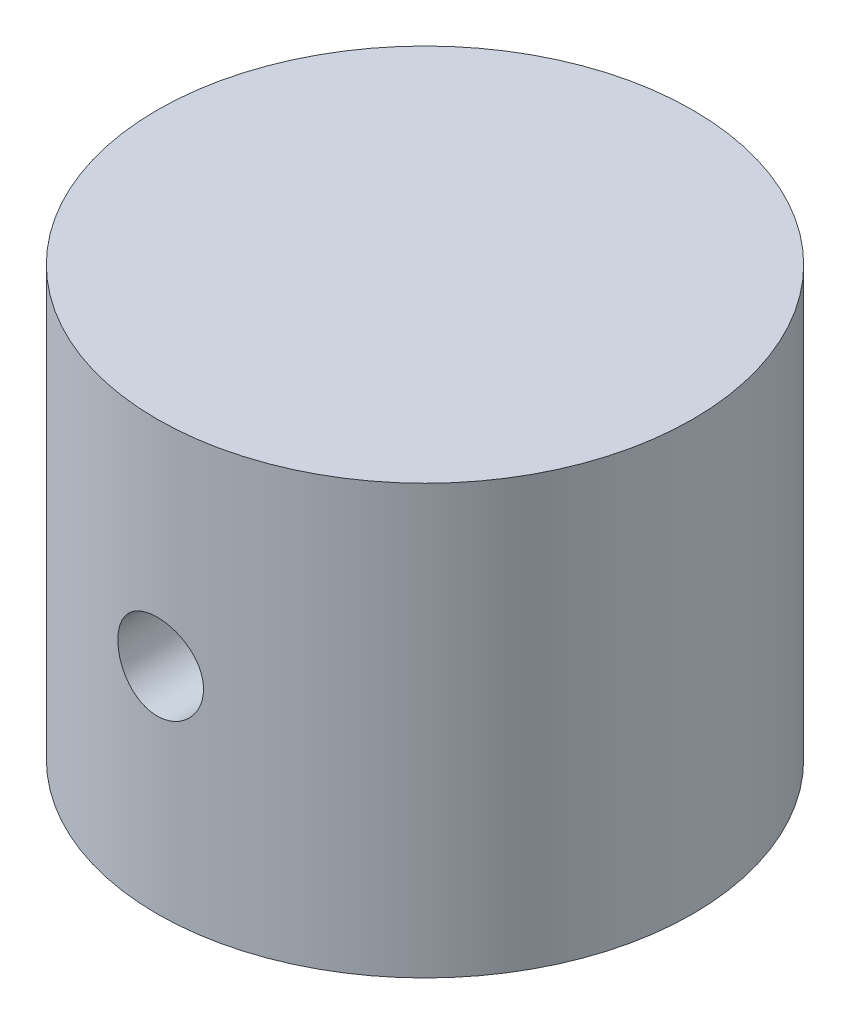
ISO-10303-21;
HEADER;
FILE_DESCRIPTION(('STEP AP214'),'2;1');
FILE_NAME('part.step','',(''),(''),'','','');
FILE_SCHEMA(('AUTOMOTIVE_DESIGN { 1 0 10303 214 1 1 1 1 }'));
ENDSEC;
DATA;
#1=APPLICATION_CONTEXT('core data for automotive mechanical design processes');
#2=APPLICATION_PROTOCOL_DEFINITION('international standard','automotive_design',2000,#1);
#3=PRODUCT_CONTEXT('',#1,'mechanical');
#4=PRODUCT('Part','Part','',(#3));
#5=PRODUCT_RELATED_PRODUCT_CATEGORY('part','',(#4));
#6=PRODUCT_DEFINITION_FORMATION('','',#4);
#7=PRODUCT_DEFINITION_CONTEXT('part definition',#1,'design');
#8=PRODUCT_DEFINITION('design','',#6,#7);
#9=PRODUCT_DEFINITION_SHAPE('','',#8);
#10=(LENGTH_UNIT() NAMED_UNIT(*) SI_UNIT(.MILLI.,.METRE.));
#11=(NAMED_UNIT(*) PLANE_ANGLE_UNIT() SI_UNIT($,.RADIAN.));
#12=(NAMED_UNIT(*) SI_UNIT($,.STERADIAN.) SOLID_ANGLE_UNIT());
#13=UNCERTAINTY_MEASURE_WITH_UNIT(LENGTH_MEASURE(1.E-05),#10,'distance_accuracy_value','');
#14=(GEOMETRIC_REPRESENTATION_CONTEXT(3) GLOBAL_UNCERTAINTY_ASSIGNED_CONTEXT((#13)) GLOBAL_UNIT_ASSIGNED_CONTEXT((#10,
#11,#12)) REPRESENTATION_CONTEXT('',''));
#15=CARTESIAN_POINT('',(0.,0.,0.));
#16=DIRECTION('',(0.,0.,1.));
#17=DIRECTION('',(1.,0.,0.));
#18=AXIS2_PLACEMENT_3D('',#15,#16,#17);
#19=CARTESIAN_POINT('',(0.,9.99999999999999,0.));
#20=DIRECTION('',(0.,1.,0.));
#21=DIRECTION('',(-1.,0.,0.));
#22=AXIS2_PLACEMENT_3D('',#19,#20,#21);
#23=CYLINDRICAL_SURFACE('',#22,12.5);
#24=CARTESIAN_POINT('',(0.,2.,-12.5));
#25=CARTESIAN_POINT('',(-0.111577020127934,1.99999547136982,-12.4999981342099));
#26=CARTESIAN_POINT('',(-0.223216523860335,1.99063139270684,-12.4984904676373));
#27=CARTESIAN_POINT('',(-0.443368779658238,1.95343555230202,-12.4926212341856));
#28=CARTESIAN_POINT('',(-0.551878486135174,1.92558639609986,-12.4882569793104));
#29=CARTESIAN_POINT('',(-0.762553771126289,1.85227911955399,-12.4771644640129));
#30=CARTESIAN_POINT('',(-0.864724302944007,1.80683495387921,-12.4704380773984));
#31=CARTESIAN_POINT('',(-1.05997584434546,1.69966320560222,-12.4553623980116));
#32=CARTESIAN_POINT('',(-1.15305798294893,1.63793764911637,-12.4470133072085));
#33=CARTESIAN_POINT('',(-1.32832749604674,1.49937439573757,-12.4295364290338));
#34=CARTESIAN_POINT('',(-1.41042286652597,1.42242102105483,-12.4204030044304));
#35=CARTESIAN_POINT('',(-1.56059410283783,1.25583553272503,-12.4024303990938));
#36=CARTESIAN_POINT('',(-1.62866911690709,1.16620264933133,-12.393591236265));
#37=CARTESIAN_POINT('',(-1.74923165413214,0.97617611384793,-12.377153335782));
#38=CARTESIAN_POINT('',(-1.80162899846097,0.875724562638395,-12.369561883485));
#39=CARTESIAN_POINT('',(-1.88877230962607,0.667304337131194,-12.3565566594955));
#40=CARTESIAN_POINT('',(-1.92351937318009,0.559336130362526,-12.3511427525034));
#41=CARTESIAN_POINT('',(-1.97408758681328,0.339919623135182,-12.3431614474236));
#42=CARTESIAN_POINT('',(-1.990067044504,0.228508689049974,-12.3405702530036));
#43=CARTESIAN_POINT('',(-2.00313711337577,0.00455901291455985,-12.3384556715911));
#44=CARTESIAN_POINT('',(-2.00022895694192,-0.107979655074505,-12.3389320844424));
#45=CARTESIAN_POINT('',(-1.97573547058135,-0.329865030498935,-12.3428771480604));
#46=CARTESIAN_POINT('',(-1.95432734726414,-0.43923187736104,-12.3463174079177));
#47=CARTESIAN_POINT('',(-1.8937194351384,-0.65280107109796,-12.3557581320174));
#48=CARTESIAN_POINT('',(-1.85451907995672,-0.757003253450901,-12.36175867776));
#49=CARTESIAN_POINT('',(-1.75925788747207,-0.957819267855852,-12.375674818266));
#50=CARTESIAN_POINT('',(-1.70312285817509,-1.05439729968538,-12.3835988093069));
#51=CARTESIAN_POINT('',(-1.57563852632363,-1.23683027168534,-12.4004630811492));
#52=CARTESIAN_POINT('',(-1.50428809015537,-1.32268441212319,-12.4094034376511));
#53=CARTESIAN_POINT('',(-1.34742984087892,-1.48225880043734,-12.4274181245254));
#54=CARTESIAN_POINT('',(-1.26176985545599,-1.55582950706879,-12.4364928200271));
#55=CARTESIAN_POINT('',(-1.07924037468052,-1.68757473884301,-12.4536592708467));
#56=CARTESIAN_POINT('',(-0.98237081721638,-1.74574917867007,-12.4617510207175));
#57=CARTESIAN_POINT('',(-0.78003588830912,-1.84506167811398,-12.4760500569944));
#58=CARTESIAN_POINT('',(-0.674564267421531,-1.88618721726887,-12.4822559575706));
#59=CARTESIAN_POINT('',(-0.45808983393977,-1.95009935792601,-12.492072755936));
#60=CARTESIAN_POINT('',(-0.34708744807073,-1.97288737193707,-12.4956838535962));
#61=CARTESIAN_POINT('',(-0.123992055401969,-1.99927647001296,-12.4998774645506));
#62=CARTESIAN_POINT('',(-0.0119239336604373,-2.00308296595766,-12.5004923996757));
#63=CARTESIAN_POINT('',(0.211249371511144,-1.99194761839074,-12.4987129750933));
#64=CARTESIAN_POINT('',(0.322354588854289,-1.97700643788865,-12.4963187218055));
#65=CARTESIAN_POINT('',(0.539818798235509,-1.92897070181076,-12.4888100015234));
#66=CARTESIAN_POINT('',(0.646200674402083,-1.89597717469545,-12.4837106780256));
#67=CARTESIAN_POINT('',(0.851922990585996,-1.81288053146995,-12.4713614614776));
#68=CARTESIAN_POINT('',(0.951263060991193,-1.7627765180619,-12.4641114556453));
#69=CARTESIAN_POINT('',(1.14097865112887,-1.64640600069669,-12.4481852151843));
#70=CARTESIAN_POINT('',(1.2312740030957,-1.58001036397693,-12.4394977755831));
#71=CARTESIAN_POINT('',(1.39951415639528,-1.43311984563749,-12.4216959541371));
#72=CARTESIAN_POINT('',(1.47745813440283,-1.35262402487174,-12.4125815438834));
#73=CARTESIAN_POINT('',(1.61953866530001,-1.17889961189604,-12.3948490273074));
#74=CARTESIAN_POINT('',(1.6835368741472,-1.08555722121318,-12.3862364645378));
#75=CARTESIAN_POINT('',(1.7949448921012,-0.889326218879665,-12.3705841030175));
#76=CARTESIAN_POINT('',(1.84235519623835,-0.786437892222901,-12.3635442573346));
#77=CARTESIAN_POINT('',(1.91903158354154,-0.574433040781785,-12.3518754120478));
#78=CARTESIAN_POINT('',(1.94836814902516,-0.465342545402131,-12.3472370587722));
#79=CARTESIAN_POINT('',(1.9882871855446,-0.243702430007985,-12.3408723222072));
#80=CARTESIAN_POINT('',(1.99887114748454,-0.13115308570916,-12.3391457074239));
#81=CARTESIAN_POINT('',(2.00094546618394,0.0928294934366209,-12.3388093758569));
#82=CARTESIAN_POINT('',(1.99265347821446,0.204260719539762,-12.3401641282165));
#83=CARTESIAN_POINT('',(1.95768017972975,0.424121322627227,-12.3457602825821));
#84=CARTESIAN_POINT('',(1.93099891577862,0.532550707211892,-12.3500016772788));
#85=CARTESIAN_POINT('',(1.86008521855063,0.743255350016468,-12.3608801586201));
#86=CARTESIAN_POINT('',(1.81587007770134,0.845536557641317,-12.3675148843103));
#87=CARTESIAN_POINT('',(1.71116577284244,1.04126446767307,-12.3824349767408));
#88=CARTESIAN_POINT('',(1.65067590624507,1.13471078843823,-12.3907204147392));
#89=CARTESIAN_POINT('',(1.51435663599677,1.31121858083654,-12.4081216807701));
#90=CARTESIAN_POINT('',(1.43836664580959,1.39415524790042,-12.417245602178));
#91=CARTESIAN_POINT('',(1.27354334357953,1.54617538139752,-12.4352300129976));
#92=CARTESIAN_POINT('',(1.18470706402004,1.61525563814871,-12.44409044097));
#93=CARTESIAN_POINT('',(0.996048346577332,1.73799746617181,-12.4606140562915));
#94=CARTESIAN_POINT('',(0.896160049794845,1.7915588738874,-12.4682693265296));
#95=CARTESIAN_POINT('',(0.688725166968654,1.88106129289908,-12.4814428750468));
#96=CARTESIAN_POINT('',(0.581186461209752,1.91702014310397,-12.4869633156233));
#97=CARTESIAN_POINT('',(0.394335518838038,1.96234573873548,-12.4940175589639));
#98=CARTESIAN_POINT('',(0.316163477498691,1.9764439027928,-12.4962491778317));
#99=CARTESIAN_POINT('',(0.158671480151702,1.99527257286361,-12.4992410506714));
#100=CARTESIAN_POINT('',(0.0793515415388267,2.00000322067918,-12.5000013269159));
#101=CARTESIAN_POINT('',(0.,2.,-12.5));
#102=B_SPLINE_CURVE_WITH_KNOTS('',3,(#24,#25,#26,#27,#28,#29,#30,#31,#32,#33,#34,#35,#36,#37,
#38,#39,#40,#41,#42,#43,#44,#45,#46,#47,#48,#49,#50,#51,#52,#53,#54,#55,#56,#57,#58,#59,#60,#61,
#62,#63,#64,#65,#66,#67,#68,#69,#70,#71,#72,#73,#74,#75,#76,#77,#78,#79,#80,#81,#82,#83,#84,#85,
#86,#87,#88,#89,#90,#91,#92,#93,#94,#95,#96,#97,#98,#99,#100,#101),.UNSPECIFIED.,.T.,.F.,(4,2,2,
2,2,2,2,2,2,2,2,2,2,2,2,2,2,2,2,2,2,2,2,2,2,2,2,2,2,2,2,2,2,2,2,2,2,2,4),(0.,0.334441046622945,
0.669197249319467,1.00368849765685,1.33813814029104,1.67523334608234,2.0123490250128,
2.35136809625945,2.69036609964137,3.0264835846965,3.36257913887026,3.695490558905,
4.02841257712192,4.36281487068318,4.69724208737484,5.0354831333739,5.37372605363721,
5.71221693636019,6.05068174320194,6.38547572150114,6.72025786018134,7.05318530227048,
7.38613020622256,7.72180459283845,8.0575013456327,8.39639027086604,8.73526908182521,
9.07281785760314,9.41033979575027,9.74398956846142,10.0776384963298,10.4109591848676,
10.7442942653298,11.0812763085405,11.4183363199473,11.7575256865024,12.0963705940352,
12.3342225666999,12.5720709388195),.UNSPECIFIED.);
#103=CARTESIAN_POINT('',(0.,2.,-12.5));
#104=VERTEX_POINT('',#103);
#105=EDGE_CURVE('E71',#104,#104,#102,.T.);
#106=ORIENTED_EDGE('',*,*,#105,.T.);
#107=EDGE_LOOP('',(#106));
#108=FACE_BOUND('',#107,.T.);
#109=CARTESIAN_POINT('',(2.,0.,12.3389626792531));
#110=CARTESIAN_POINT('',(1.99999546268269,-0.1115667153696,12.3389646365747));
#111=CARTESIAN_POINT('',(1.99063305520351,-0.223195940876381,12.3404922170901));
#112=CARTESIAN_POINT('',(1.95344445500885,-0.443326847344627,12.3464325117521));
#113=CARTESIAN_POINT('',(1.92560083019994,-0.551825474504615,12.3508479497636));
#114=CARTESIAN_POINT('',(1.85230972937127,-0.762477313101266,12.3620513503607));
#115=CARTESIAN_POINT('',(1.8068764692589,-0.864635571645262,12.3688373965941));
#116=CARTESIAN_POINT('',(1.69973041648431,-1.05986648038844,12.3840151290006));
#117=CARTESIAN_POINT('',(1.63801962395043,-1.15294024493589,12.3924066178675));
#118=CARTESIAN_POINT('',(1.4994714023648,-1.32821893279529,12.409935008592));
#119=CARTESIAN_POINT('',(1.42251498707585,-1.41032926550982,12.4190774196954));
#120=CARTESIAN_POINT('',(1.25591709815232,-1.56052945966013,12.4370285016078));
#121=CARTESIAN_POINT('',(1.16627489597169,-1.62861851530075,12.4458371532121));
#122=CARTESIAN_POINT('',(0.976239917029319,-1.7491959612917,12.4621862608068));
#123=CARTESIAN_POINT('',(0.875790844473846,-1.80159669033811,12.4697194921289));
#124=CARTESIAN_POINT('',(0.66737599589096,-1.88874693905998,12.4826077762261));
#125=CARTESIAN_POINT('',(0.559410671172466,-1.92349751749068,12.4879629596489));
#126=CARTESIAN_POINT('',(0.340004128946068,-1.97407274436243,12.4958528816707));
#127=CARTESIAN_POINT('',(0.228600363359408,-1.99005611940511,12.49841126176));
#128=CARTESIAN_POINT('',(0.00466480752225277,-2.00313650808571,12.500500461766));
#129=CARTESIAN_POINT('',(-0.10786691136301,-2.00023470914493,12.5000314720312));
#130=CARTESIAN_POINT('',(-0.32977971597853,-1.97575151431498,12.4961375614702));
#131=CARTESIAN_POINT('',(-0.439180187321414,-1.95434091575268,12.4927396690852));
#132=CARTESIAN_POINT('',(-0.652815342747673,-1.89371648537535,12.4833998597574));
#133=CARTESIAN_POINT('',(-0.757049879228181,-1.85450214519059,12.4774578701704));
#134=CARTESIAN_POINT('',(-0.957905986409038,-1.75921154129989,12.4636513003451));
#135=CARTESIAN_POINT('',(-1.05449329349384,-1.70306427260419,12.4557786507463));
#136=CARTESIAN_POINT('',(-1.23693967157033,-1.57555357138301,12.4389865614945));
#137=CARTESIAN_POINT('',(-1.32279794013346,-1.50418900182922,12.4300670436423));
#138=CARTESIAN_POINT('',(-1.48235721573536,-1.34732043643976,12.4120565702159));
#139=CARTESIAN_POINT('',(-1.555911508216,-1.2616672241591,12.4029648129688));
#140=CARTESIAN_POINT('',(-1.68762680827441,-1.07915724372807,12.3857313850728));
#141=CARTESIAN_POINT('',(-1.74578769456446,-0.982300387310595,12.3775897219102));
#142=CARTESIAN_POINT('',(-1.84509031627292,-0.779969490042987,12.3631781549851));
#143=CARTESIAN_POINT('',(-1.88621545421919,-0.674487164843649,12.3569100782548));
#144=CARTESIAN_POINT('',(-1.95012354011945,-0.457989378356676,12.3469864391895));
#145=CARTESIAN_POINT('',(-1.97290796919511,-0.346974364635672,12.343330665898));
#146=CARTESIAN_POINT('',(-1.99928349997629,-0.123872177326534,12.3390860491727));
#147=CARTESIAN_POINT('',(-2.0030832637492,-0.0118102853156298,12.338463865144));
#148=CARTESIAN_POINT('',(-1.99193667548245,0.211348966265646,12.3402681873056));
#149=CARTESIAN_POINT('',(-1.97699098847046,0.322446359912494,12.3426945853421));
#150=CARTESIAN_POINT('',(-1.92895527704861,0.539866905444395,12.3502919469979));
#151=CARTESIAN_POINT('',(-1.89597053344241,0.646213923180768,12.3554469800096));
#152=CARTESIAN_POINT('',(-1.81290306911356,0.85187038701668,12.3679074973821));
#153=CARTESIAN_POINT('',(-1.76281939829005,0.951179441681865,12.3752131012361));
#154=CARTESIAN_POINT('',(-1.64647965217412,1.14087239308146,12.3912295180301));
#155=CARTESIAN_POINT('',(-1.58008930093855,1.23117295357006,12.3999517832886));
#156=CARTESIAN_POINT('',(-1.43320604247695,1.39942606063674,12.4177848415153));
#157=CARTESIAN_POINT('',(-1.35271222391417,1.47737780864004,12.426895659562));
#158=CARTESIAN_POINT('',(-1.17898475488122,1.61947729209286,12.4445842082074));
#159=CARTESIAN_POINT('',(-1.08563688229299,1.68348622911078,12.4531560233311));
#160=CARTESIAN_POINT('',(-0.889391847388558,1.7949130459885,12.4687070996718));
#161=CARTESIAN_POINT('',(-0.786494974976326,1.8423314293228,12.4756864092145));
#162=CARTESIAN_POINT('',(-0.57449377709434,1.91901272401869,12.4872402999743));
#163=CARTESIAN_POINT('',(-0.465416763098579,1.94834960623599,12.4918246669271));
#164=CARTESIAN_POINT('',(-0.243805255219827,1.98827383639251,12.4981133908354));
#165=CARTESIAN_POINT('',(-0.131271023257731,1.99886260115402,12.4998179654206));
#166=CARTESIAN_POINT('',(0.0927181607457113,2.00095179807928,12.5001523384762));
#167=CARTESIAN_POINT('',(0.204171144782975,1.99266389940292,12.4988162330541));
#168=CARTESIAN_POINT('',(0.424076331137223,1.95769116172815,12.4932886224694));
#169=CARTESIAN_POINT('',(0.532528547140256,1.93100640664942,12.4890971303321));
#170=CARTESIAN_POINT('',(0.743282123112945,1.86007617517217,12.4783277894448));
#171=CARTESIAN_POINT('',(0.845589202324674,1.81584732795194,12.471752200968));
#172=CARTESIAN_POINT('',(1.0413631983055,1.71110753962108,12.4569342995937));
#173=CARTESIAN_POINT('',(1.13482974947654,1.65059592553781,12.4486919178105));
#174=CARTESIAN_POINT('',(1.31133889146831,1.51425167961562,12.4313454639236));
#175=CARTESIAN_POINT('',(1.39426053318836,1.4382634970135,12.4222331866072));
#176=CARTESIAN_POINT('',(1.54625119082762,1.27345013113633,12.4042323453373));
#177=CARTESIAN_POINT('',(1.61531695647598,1.18462194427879,12.3953438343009));
#178=CARTESIAN_POINT('',(1.73804191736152,0.995970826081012,12.3787350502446));
#179=CARTESIAN_POINT('',(1.79159866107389,0.896080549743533,12.3710226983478));
#180=CARTESIAN_POINT('',(1.88109182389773,0.688641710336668,12.35773272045));
#181=CARTESIAN_POINT('',(1.91704612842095,0.581101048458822,12.3521529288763));
#182=CARTESIAN_POINT('',(1.96235985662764,0.394262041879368,12.3450187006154));
#183=CARTESIAN_POINT('',(1.97645270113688,0.316104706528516,12.3427600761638));
#184=CARTESIAN_POINT('',(1.99527431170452,0.158642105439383,12.339731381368));
#185=CARTESIAN_POINT('',(2.00000322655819,0.0793368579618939,12.3389612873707));
#186=CARTESIAN_POINT('',(2.,0.,12.3389626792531));
#187=B_SPLINE_CURVE_WITH_KNOTS('',3,(#109,#110,#111,#112,#113,#114,#115,#116,#117,#118,#119,
#120,#121,#122,#123,#124,#125,#126,#127,#128,#129,#130,#131,#132,#133,#134,#135,#136,#137,#138,
#139,#140,#141,#142,#143,#144,#145,#146,#147,#148,#149,#150,#151,#152,#153,#154,#155,#156,#157,
#158,#159,#160,#161,#162,#163,#164,#165,#166,#167,#168,#169,#170,#171,#172,#173,#174,#175,#176,
#177,#178,#179,#180,#181,#182,#183,#184,#185,#186),.UNSPECIFIED.,.T.,.F.,(4,2,2,2,2,2,2,2,2,2,2,
2,2,2,2,2,2,2,2,2,2,2,2,2,2,2,2,2,2,2,2,2,2,2,2,2,2,2,4),(0.,0.334410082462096,
0.669136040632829,1.00359203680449,1.33800695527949,1.6751426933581,2.01229780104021,
2.35130309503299,2.69028805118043,3.02638485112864,3.36246051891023,3.69546762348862,
4.0284842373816,4.36291718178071,4.69737512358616,5.03557384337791,5.37377522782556,
5.71230534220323,6.05080811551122,6.3855820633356,6.72034413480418,7.05317297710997,
7.38602031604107,7.7217061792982,8.05741374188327,8.39632425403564,8.73522448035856,
9.07272891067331,9.41020783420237,9.74392117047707,10.0776329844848,10.4110292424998,
10.7444392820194,11.0813822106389,11.4184040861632,11.7576040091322,12.0964585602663,
12.3342666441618,12.5720709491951),.UNSPECIFIED.);
#188=CARTESIAN_POINT('',(2.,0.,12.3389626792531));
#189=VERTEX_POINT('',#188);
#190=EDGE_CURVE('E75',#189,#189,#187,.T.);
#191=ORIENTED_EDGE('',*,*,#190,.T.);
#192=EDGE_LOOP('',(#191));
#193=FACE_BOUND('',#192,.T.);
#194=CARTESIAN_POINT('',(0.,10.,0.));
#195=DIRECTION('',(0.,1.,0.));
#196=DIRECTION('',(-1.,0.,0.));
#197=AXIS2_PLACEMENT_3D('',#194,#195,#196);
#198=CIRCLE('',#197,12.5);
#199=CARTESIAN_POINT('',(-12.5,10.,0.));
#200=VERTEX_POINT('',#199);
#201=EDGE_CURVE('E79',#200,#200,#198,.T.);
#202=ORIENTED_EDGE('',*,*,#201,.F.);
#203=EDGE_LOOP('',(#202));
#204=FACE_BOUND('',#203,.T.);
#205=CARTESIAN_POINT('',(0.,-10.,0.));
#206=DIRECTION('',(0.,1.,0.));
#207=DIRECTION('',(-1.,0.,0.));
#208=AXIS2_PLACEMENT_3D('',#205,#206,#207);
#209=CIRCLE('',#208,12.5);
#210=CARTESIAN_POINT('',(-12.5,-9.99999999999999,0.));
#211=VERTEX_POINT('',#210);
#212=EDGE_CURVE('E11',#211,#211,#209,.T.);
#213=ORIENTED_EDGE('',*,*,#212,.T.);
#214=EDGE_LOOP('',(#213));
#215=FACE_BOUND('',#214,.T.);
#216=ADVANCED_FACE('F30',(#108,#193,#204,#215),#23,.T.);
#217=CARTESIAN_POINT('',(6.,-10.,0.));
#218=DIRECTION('',(0.,1.,0.));
#219=DIRECTION('',(-1.,0.,0.));
#220=AXIS2_PLACEMENT_3D('',#217,#218,#219);
#221=PLANE('',#220);
#222=ORIENTED_EDGE('',*,*,#212,.F.);
#223=EDGE_LOOP('',(#222));
#224=FACE_BOUND('',#223,.T.);
#225=CARTESIAN_POINT('',(0.,-10.,0.));
#226=DIRECTION('',(0.,1.,0.));
#227=DIRECTION('',(-1.,0.,0.));
#228=AXIS2_PLACEMENT_3D('',#225,#226,#227);
#229=CIRCLE('',#228,6.);
#230=CARTESIAN_POINT('',(-6.00000000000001,-10.,0.));
#231=VERTEX_POINT('',#230);
#232=EDGE_CURVE('E42',#231,#231,#229,.T.);
#233=ORIENTED_EDGE('',*,*,#232,.T.);
#234=EDGE_LOOP('',(#233));
#235=FACE_BOUND('',#234,.T.);
#236=ADVANCED_FACE('F59',(#224,#235),#221,.F.);
#237=CARTESIAN_POINT('',(0.,9.99999999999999,0.));
#238=DIRECTION('',(0.,1.,0.));
#239=DIRECTION('',(-1.,0.,0.));
#240=AXIS2_PLACEMENT_3D('',#237,#238,#239);
#241=CYLINDRICAL_SURFACE('',#240,6.);
#242=CARTESIAN_POINT('',(2.,0.,-5.65685424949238));
#243=CARTESIAN_POINT('',(2.00000051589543,-0.108936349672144,-5.65685389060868));
#244=CARTESIAN_POINT('',(1.99106956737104,-0.217869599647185,-5.66003538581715));
#245=CARTESIAN_POINT('',(1.95570226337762,-0.432508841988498,-5.6723514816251));
#246=CARTESIAN_POINT('',(1.92926302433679,-0.538214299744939,-5.68148706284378));
#247=CARTESIAN_POINT('',(1.85991097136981,-0.743253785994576,-5.70456407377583));
#248=CARTESIAN_POINT('',(1.81703044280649,-0.842599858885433,-5.71849607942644));
#249=CARTESIAN_POINT('',(1.71612325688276,-1.03272009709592,-5.74958244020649));
#250=CARTESIAN_POINT('',(1.65809325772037,-1.12349236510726,-5.76673750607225));
#251=CARTESIAN_POINT('',(1.52610229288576,-1.29743992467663,-5.80308978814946));
#252=CARTESIAN_POINT('',(1.45164868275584,-1.38023085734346,-5.82233789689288));
#253=CARTESIAN_POINT('',(1.28997533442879,-1.53241360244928,-5.86027729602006));
#254=CARTESIAN_POINT('',(1.20275355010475,-1.60180326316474,-5.87896849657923));
#255=CARTESIAN_POINT('',(1.01520901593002,-1.72695779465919,-5.91427733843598));
#256=CARTESIAN_POINT('',(0.91460382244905,-1.78231994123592,-5.93082815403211));
#257=CARTESIAN_POINT('',(0.704862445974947,-1.87518317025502,-5.95939173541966));
#258=CARTESIAN_POINT('',(0.595728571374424,-1.91268906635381,-5.97140572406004));
#259=CARTESIAN_POINT('',(0.376057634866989,-1.96747170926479,-5.98918150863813));
#260=CARTESIAN_POINT('',(0.265701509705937,-1.98540689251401,-5.99514629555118));
#261=CARTESIAN_POINT('',(0.043395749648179,-2.00263258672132,-6.00087216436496));
#262=CARTESIAN_POINT('',(-0.0685534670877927,-2.00192790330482,-6.00063484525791));
#263=CARTESIAN_POINT('',(-0.286207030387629,-1.98231149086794,-5.99412079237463));
#264=CARTESIAN_POINT('',(-0.391984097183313,-1.96411494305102,-5.98808129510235));
#265=CARTESIAN_POINT('',(-0.598886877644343,-1.91121403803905,-5.97093934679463));
#266=CARTESIAN_POINT('',(-0.700012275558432,-1.87650856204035,-5.95983655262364));
#267=CARTESIAN_POINT('',(-0.896304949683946,-1.79115736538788,-5.93351340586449));
#268=CARTESIAN_POINT('',(-0.99137644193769,-1.74030812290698,-5.91824085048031));
#269=CARTESIAN_POINT('',(-1.17184865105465,-1.62428058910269,-5.88516786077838));
#270=CARTESIAN_POINT('',(-1.25724666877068,-1.55909831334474,-5.86736672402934));
#271=CARTESIAN_POINT('',(-1.42020173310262,-1.4126512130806,-5.83012383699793));
#272=CARTESIAN_POINT('',(-1.49720031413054,-1.33077368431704,-5.81064430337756));
#273=CARTESIAN_POINT('',(-1.63655451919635,-1.15510254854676,-5.77294670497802));
#274=CARTESIAN_POINT('',(-1.69890788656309,-1.06130710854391,-5.75472883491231));
#275=CARTESIAN_POINT('',(-1.80797491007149,-0.862692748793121,-5.72141050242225));
#276=CARTESIAN_POINT('',(-1.85445292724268,-0.757735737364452,-5.70635818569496));
#277=CARTESIAN_POINT('',(-1.92888638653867,-0.540857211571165,-5.6816330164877));
#278=CARTESIAN_POINT('',(-1.95684959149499,-0.428938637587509,-5.67195790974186));
#279=CARTESIAN_POINT('',(-1.99232256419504,-0.206723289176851,-5.6595927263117));
#280=CARTESIAN_POINT('',(-2.00069819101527,-0.0965811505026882,-5.65660720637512));
#281=CARTESIAN_POINT('',(-1.99921087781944,0.123552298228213,-5.65713344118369));
#282=CARTESIAN_POINT('',(-1.98935125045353,0.233543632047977,-5.66064401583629));
#283=CARTESIAN_POINT('',(-1.95245130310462,0.446313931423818,-5.67347236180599));
#284=CARTESIAN_POINT('',(-1.92601278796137,0.549210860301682,-5.68258650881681));
#285=CARTESIAN_POINT('',(-1.85742772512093,0.749087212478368,-5.70537107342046));
#286=CARTESIAN_POINT('',(-1.81527839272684,0.84606558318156,-5.71904229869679));
#287=CARTESIAN_POINT('',(-1.71494868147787,1.034760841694,-5.74993755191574));
#288=CARTESIAN_POINT('',(-1.65630223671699,1.1262132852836,-5.76726051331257));
#289=CARTESIAN_POINT('',(-1.52517126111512,1.29829210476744,-5.80331537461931));
#290=CARTESIAN_POINT('',(-1.45268265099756,1.37891527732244,-5.82204768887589));
#291=CARTESIAN_POINT('',(-1.29178341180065,1.53105596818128,-5.85990077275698));
#292=CARTESIAN_POINT('',(-1.2027745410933,1.6019487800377,-5.87899687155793));
#293=CARTESIAN_POINT('',(-1.01365458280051,1.72783228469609,-5.91453703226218));
#294=CARTESIAN_POINT('',(-0.913543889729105,1.78282354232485,-5.9309811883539));
#295=CARTESIAN_POINT('',(-0.705559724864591,1.87484020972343,-5.95928811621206));
#296=CARTESIAN_POINT('',(-0.597742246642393,1.91198255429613,-5.97118060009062));
#297=CARTESIAN_POINT('',(-0.376916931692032,1.96745548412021,-5.98917221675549));
#298=CARTESIAN_POINT('',(-0.263910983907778,1.98579285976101,-5.99527344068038));
#299=CARTESIAN_POINT('',(-0.0416306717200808,2.00252415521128,-6.00083726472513));
#300=CARTESIAN_POINT('',(0.0675694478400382,2.00181490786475,-6.00059840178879));
#301=CARTESIAN_POINT('',(0.284222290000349,1.98268538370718,-5.99424393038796));
#302=CARTESIAN_POINT('',(0.391675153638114,1.96426654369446,-5.98812879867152));
#303=CARTESIAN_POINT('',(0.600084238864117,1.91083553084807,-5.97081829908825));
#304=CARTESIAN_POINT('',(0.701116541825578,1.87609156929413,-5.95970516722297));
#305=CARTESIAN_POINT('',(0.895956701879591,1.79124493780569,-5.9335432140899));
#306=CARTESIAN_POINT('',(0.989763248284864,1.74113948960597,-5.91849368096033));
#307=CARTESIAN_POINT('',(1.17126803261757,1.62486097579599,-5.88531737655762));
#308=CARTESIAN_POINT('',(1.25861250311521,1.55816262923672,-5.86709744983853));
#309=CARTESIAN_POINT('',(1.42116205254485,1.41148521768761,-5.82985977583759));
#310=CARTESIAN_POINT('',(1.49636324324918,1.33150191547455,-5.81084177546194));
#311=CARTESIAN_POINT('',(1.63548361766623,1.1567812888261,-5.77326559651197));
#312=CARTESIAN_POINT('',(1.6988459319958,1.06158897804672,-5.75475455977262));
#313=CARTESIAN_POINT('',(1.80862868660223,0.861331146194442,-5.72120386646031));
#314=CARTESIAN_POINT('',(1.85505355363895,0.756268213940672,-5.70616330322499));
#315=CARTESIAN_POINT('',(1.92768765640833,0.544076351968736,-5.68202668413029));
#316=CARTESIAN_POINT('',(1.95471581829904,0.437255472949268,-5.67269265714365));
#317=CARTESIAN_POINT('',(1.99086864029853,0.220287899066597,-5.66010767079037));
#318=CARTESIAN_POINT('',(1.99999947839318,0.110142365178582,-5.65685461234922));
#319=CARTESIAN_POINT('',(2.,0.,-5.65685424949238));
#320=B_SPLINE_CURVE_WITH_KNOTS('',3,(#242,#243,#244,#245,#246,#247,#248,#249,#250,#251,#252,
#253,#254,#255,#256,#257,#258,#259,#260,#261,#262,#263,#264,#265,#266,#267,#268,#269,#270,#271,
#272,#273,#274,#275,#276,#277,#278,#279,#280,#281,#282,#283,#284,#285,#286,#287,#288,#289,#290,
#291,#292,#293,#294,#295,#296,#297,#298,#299,#300,#301,#302,#303,#304,#305,#306,#307,#308,#309,
#310,#311,#312,#313,#314,#315,#316,#317,#318,#319),.UNSPECIFIED.,.T.,.F.,(4,2,2,2,2,2,2,2,2,2,2,
2,2,2,2,2,2,2,2,2,2,2,2,2,2,2,2,2,2,2,2,2,2,2,2,2,2,2,4),(0.,0.326401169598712,
0.652856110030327,0.978673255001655,1.30456233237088,1.64202674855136,1.97954530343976,
2.32587012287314,2.67210152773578,3.00628637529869,3.34038506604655,3.66138009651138,
3.98239688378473,4.3076330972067,4.63295983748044,4.97360348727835,5.31429959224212,
5.65985279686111,6.00526102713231,6.33508582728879,6.66485071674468,6.98328791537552,
7.30178158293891,7.6303771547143,7.95906971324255,8.30357616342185,8.64807037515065,
8.99027582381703,9.33235766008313,9.65836169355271,9.98433928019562,10.3051391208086,
10.6259970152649,10.9587103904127,11.2915300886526,11.6373780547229,11.9831355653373,
12.3132642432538,12.6432789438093),.UNSPECIFIED.);
#321=CARTESIAN_POINT('',(2.,0.,-5.65685424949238));
#322=VERTEX_POINT('',#321);
#323=EDGE_CURVE('E34',#322,#322,#320,.T.);
#324=ORIENTED_EDGE('',*,*,#323,.T.);
#325=EDGE_LOOP('',(#324));
#326=FACE_BOUND('',#325,.T.);
#327=CARTESIAN_POINT('',(2.,0.,5.65685424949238));
#328=CARTESIAN_POINT('',(2.00000051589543,0.108936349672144,5.65685389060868));
#329=CARTESIAN_POINT('',(1.99106956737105,0.217869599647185,5.66003538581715));
#330=CARTESIAN_POINT('',(1.95570226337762,0.432508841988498,5.6723514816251));
#331=CARTESIAN_POINT('',(1.92926302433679,0.538214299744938,5.68148706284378));
#332=CARTESIAN_POINT('',(1.85991097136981,0.743253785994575,5.70456407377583));
#333=CARTESIAN_POINT('',(1.81703044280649,0.842599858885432,5.71849607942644));
#334=CARTESIAN_POINT('',(1.71612325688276,1.03272009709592,5.74958244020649));
#335=CARTESIAN_POINT('',(1.65809325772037,1.12349236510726,5.76673750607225));
#336=CARTESIAN_POINT('',(1.52610229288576,1.29743992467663,5.80308978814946));
#337=CARTESIAN_POINT('',(1.45164868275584,1.38023085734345,5.82233789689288));
#338=CARTESIAN_POINT('',(1.28997533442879,1.53241360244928,5.86027729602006));
#339=CARTESIAN_POINT('',(1.20275355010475,1.60180326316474,5.87896849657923));
#340=CARTESIAN_POINT('',(1.01520901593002,1.72695779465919,5.91427733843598));
#341=CARTESIAN_POINT('',(0.914603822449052,1.78231994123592,5.93082815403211));
#342=CARTESIAN_POINT('',(0.704862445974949,1.87518317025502,5.95939173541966));
#343=CARTESIAN_POINT('',(0.595728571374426,1.91268906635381,5.97140572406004));
#344=CARTESIAN_POINT('',(0.37605763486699,1.96747170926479,5.98918150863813));
#345=CARTESIAN_POINT('',(0.265701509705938,1.98540689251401,5.99514629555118));
#346=CARTESIAN_POINT('',(0.0433957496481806,2.00263258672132,6.00087216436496));
#347=CARTESIAN_POINT('',(-0.0685534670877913,2.00192790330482,6.00063484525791));
#348=CARTESIAN_POINT('',(-0.286207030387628,1.98231149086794,5.99412079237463));
#349=CARTESIAN_POINT('',(-0.391984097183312,1.96411494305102,5.98808129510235));
#350=CARTESIAN_POINT('',(-0.598886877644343,1.91121403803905,5.97093934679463));
#351=CARTESIAN_POINT('',(-0.700012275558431,1.87650856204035,5.95983655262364));
#352=CARTESIAN_POINT('',(-0.896304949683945,1.79115736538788,5.93351340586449));
#353=CARTESIAN_POINT('',(-0.99137644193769,1.74030812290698,5.91824085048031));
#354=CARTESIAN_POINT('',(-1.17184865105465,1.62428058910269,5.88516786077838));
#355=CARTESIAN_POINT('',(-1.25724666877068,1.55909831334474,5.86736672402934));
#356=CARTESIAN_POINT('',(-1.42020173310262,1.4126512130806,5.83012383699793));
#357=CARTESIAN_POINT('',(-1.49720031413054,1.33077368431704,5.81064430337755));
#358=CARTESIAN_POINT('',(-1.63655451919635,1.15510254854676,5.77294670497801));
#359=CARTESIAN_POINT('',(-1.69890788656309,1.06130710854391,5.75472883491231));
#360=CARTESIAN_POINT('',(-1.80797491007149,0.86269274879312,5.72141050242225));
#361=CARTESIAN_POINT('',(-1.85445292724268,0.757735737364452,5.70635818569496));
#362=CARTESIAN_POINT('',(-1.92888638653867,0.540857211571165,5.6816330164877));
#363=CARTESIAN_POINT('',(-1.95684959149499,0.428938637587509,5.67195790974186));
#364=CARTESIAN_POINT('',(-1.99232256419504,0.206723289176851,5.6595927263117));
#365=CARTESIAN_POINT('',(-2.00069819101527,0.0965811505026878,5.65660720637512));
#366=CARTESIAN_POINT('',(-1.99921087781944,-0.123552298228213,5.65713344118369));
#367=CARTESIAN_POINT('',(-1.98935125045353,-0.233543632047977,5.66064401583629));
#368=CARTESIAN_POINT('',(-1.95245130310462,-0.446313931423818,5.67347236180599));
#369=CARTESIAN_POINT('',(-1.92601278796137,-0.549210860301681,5.68258650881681));
#370=CARTESIAN_POINT('',(-1.85742772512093,-0.749087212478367,5.70537107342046));
#371=CARTESIAN_POINT('',(-1.81527839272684,-0.846065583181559,5.71904229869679));
#372=CARTESIAN_POINT('',(-1.71494868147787,-1.03476084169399,5.74993755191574));
#373=CARTESIAN_POINT('',(-1.65630223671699,-1.1262132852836,5.76726051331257));
#374=CARTESIAN_POINT('',(-1.52517126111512,-1.29829210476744,5.80331537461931));
#375=CARTESIAN_POINT('',(-1.45268265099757,-1.37891527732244,5.82204768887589));
#376=CARTESIAN_POINT('',(-1.29178341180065,-1.53105596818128,5.85990077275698));
#377=CARTESIAN_POINT('',(-1.20277454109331,-1.6019487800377,5.87899687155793));
#378=CARTESIAN_POINT('',(-1.01365458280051,-1.72783228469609,5.91453703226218));
#379=CARTESIAN_POINT('',(-0.913543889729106,-1.78282354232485,5.9309811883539));
#380=CARTESIAN_POINT('',(-0.705559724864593,-1.87484020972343,5.95928811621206));
#381=CARTESIAN_POINT('',(-0.597742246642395,-1.91198255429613,5.97118060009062));
#382=CARTESIAN_POINT('',(-0.376916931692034,-1.96745548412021,5.98917221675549));
#383=CARTESIAN_POINT('',(-0.26391098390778,-1.98579285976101,5.99527344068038));
#384=CARTESIAN_POINT('',(-0.0416306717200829,-2.00252415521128,6.00083726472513));
#385=CARTESIAN_POINT('',(0.067569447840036,-2.00181490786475,6.00059840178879));
#386=CARTESIAN_POINT('',(0.284222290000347,-1.98268538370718,5.99424393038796));
#387=CARTESIAN_POINT('',(0.391675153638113,-1.96426654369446,5.98812879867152));
#388=CARTESIAN_POINT('',(0.600084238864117,-1.91083553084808,5.97081829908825));
#389=CARTESIAN_POINT('',(0.701116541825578,-1.87609156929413,5.95970516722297));
#390=CARTESIAN_POINT('',(0.895956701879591,-1.79124493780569,5.9335432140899));
#391=CARTESIAN_POINT('',(0.989763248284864,-1.74113948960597,5.91849368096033));
#392=CARTESIAN_POINT('',(1.17126803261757,-1.62486097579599,5.88531737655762));
#393=CARTESIAN_POINT('',(1.25861250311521,-1.55816262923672,5.86709744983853));
#394=CARTESIAN_POINT('',(1.42116205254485,-1.41148521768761,5.82985977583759));
#395=CARTESIAN_POINT('',(1.49636324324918,-1.33150191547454,5.81084177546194));
#396=CARTESIAN_POINT('',(1.63548361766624,-1.1567812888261,5.77326559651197));
#397=CARTESIAN_POINT('',(1.6988459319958,-1.06158897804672,5.75475455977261));
#398=CARTESIAN_POINT('',(1.80862868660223,-0.86133114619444,5.72120386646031));
#399=CARTESIAN_POINT('',(1.85505355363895,-0.75626821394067,5.70616330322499));
#400=CARTESIAN_POINT('',(1.92768765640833,-0.544076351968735,5.68202668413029));
#401=CARTESIAN_POINT('',(1.95471581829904,-0.437255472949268,5.67269265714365));
#402=CARTESIAN_POINT('',(1.99086864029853,-0.220287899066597,5.66010767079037));
#403=CARTESIAN_POINT('',(1.99999947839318,-0.110142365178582,5.65685461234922));
#404=CARTESIAN_POINT('',(2.,0.,5.65685424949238));
#405=B_SPLINE_CURVE_WITH_KNOTS('',3,(#327,#328,#329,#330,#331,#332,#333,#334,#335,#336,#337,
#338,#339,#340,#341,#342,#343,#344,#345,#346,#347,#348,#349,#350,#351,#352,#353,#354,#355,#356,
#357,#358,#359,#360,#361,#362,#363,#364,#365,#366,#367,#368,#369,#370,#371,#372,#373,#374,#375,
#376,#377,#378,#379,#380,#381,#382,#383,#384,#385,#386,#387,#388,#389,#390,#391,#392,#393,#394,
#395,#396,#397,#398,#399,#400,#401,#402,#403,#404),.UNSPECIFIED.,.T.,.F.,(4,2,2,2,2,2,2,2,2,2,2,
2,2,2,2,2,2,2,2,2,2,2,2,2,2,2,2,2,2,2,2,2,2,2,2,2,2,2,4),(0.,0.326401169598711,
0.652856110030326,0.978673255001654,1.30456233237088,1.64202674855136,1.97954530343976,
2.32587012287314,2.67210152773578,3.00628637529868,3.34038506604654,3.66138009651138,
3.98239688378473,4.3076330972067,4.63295983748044,4.97360348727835,5.31429959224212,
5.65985279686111,6.00526102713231,6.33508582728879,6.66485071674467,6.98328791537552,
7.30178158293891,7.63037715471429,7.95906971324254,8.30357616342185,8.64807037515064,
8.99027582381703,9.33235766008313,9.65836169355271,9.98433928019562,10.3051391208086,
10.6259970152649,10.9587103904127,11.2915300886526,11.6373780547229,11.9831355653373,
12.3132642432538,12.6432789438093),.UNSPECIFIED.);
#406=CARTESIAN_POINT('',(2.,0.,5.65685424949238));
#407=VERTEX_POINT('',#406);
#408=EDGE_CURVE('E90',#407,#407,#405,.T.);
#409=ORIENTED_EDGE('',*,*,#408,.T.);
#410=EDGE_LOOP('',(#409));
#411=FACE_BOUND('',#410,.T.);
#412=ORIENTED_EDGE('',*,*,#232,.F.);
#413=EDGE_LOOP('',(#412));
#414=FACE_BOUND('',#413,.T.);
#415=CARTESIAN_POINT('',(0.,4.53589838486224,0.));
#416=DIRECTION('',(0.,1.,0.));
#417=DIRECTION('',(-1.,0.,0.));
#418=AXIS2_PLACEMENT_3D('',#415,#416,#417);
#419=CIRCLE('',#418,6.);
#420=CARTESIAN_POINT('',(-6.,4.53589838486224,0.));
#421=VERTEX_POINT('',#420);
#422=EDGE_CURVE('E85',#421,#421,#419,.T.);
#423=ORIENTED_EDGE('',*,*,#422,.T.);
#424=EDGE_LOOP('',(#423));
#425=FACE_BOUND('',#424,.T.);
#426=ADVANCED_FACE('F49',(#326,#411,#414,#425),#241,.F.);
#427=CARTESIAN_POINT('',(0.,8.,0.));
#428=DIRECTION('',(0.,-1.,0.));
#429=DIRECTION('',(1.,0.,0.));
#430=AXIS2_PLACEMENT_3D('',#427,#428,#429);
#431=CONICAL_SURFACE('',#430,0.,1.0471975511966);
#432=ORIENTED_EDGE('',*,*,#422,.F.);
#433=EDGE_LOOP('',(#432));
#434=FACE_BOUND('',#433,.T.);
#435=CARTESIAN_POINT('',(0.,8.,0.));
#436=VERTEX_POINT('',#435);
#437=VERTEX_LOOP('',#436);
#438=FACE_BOUND('',#437,.T.);
#439=ADVANCED_FACE('F46',(#434,#438),#431,.F.);
#440=CARTESIAN_POINT('',(12.5,10.,0.));
#441=DIRECTION('',(0.,-1.,0.));
#442=DIRECTION('',(1.,0.,0.));
#443=AXIS2_PLACEMENT_3D('',#440,#441,#442);
#444=PLANE('',#443);
#445=ORIENTED_EDGE('',*,*,#201,.T.);
#446=EDGE_LOOP('',(#445));
#447=FACE_BOUND('',#446,.T.);
#448=ADVANCED_FACE('F48',(#447),#444,.F.);
#449=CARTESIAN_POINT('',(0.,0.,-12.5));
#450=DIRECTION('',(0.,0.,1.));
#451=DIRECTION('',(1.,0.,0.));
#452=AXIS2_PLACEMENT_3D('',#449,#450,#451);
#453=CYLINDRICAL_SURFACE('',#452,2.);
#454=ORIENTED_EDGE('',*,*,#408,.F.);
#455=EDGE_LOOP('',(#454));
#456=FACE_BOUND('',#455,.T.);
#457=ORIENTED_EDGE('',*,*,#190,.F.);
#458=EDGE_LOOP('',(#457));
#459=FACE_BOUND('',#458,.T.);
#460=ADVANCED_FACE('F56',(#456,#459),#453,.F.);
#461=ORIENTED_EDGE('',*,*,#323,.F.);
#462=EDGE_LOOP('',(#461));
#463=FACE_BOUND('',#462,.T.);
#464=ORIENTED_EDGE('',*,*,#105,.F.);
#465=EDGE_LOOP('',(#464));
#466=FACE_BOUND('',#465,.T.);
#467=ADVANCED_FACE('F95',(#463,#466),#453,.F.);
#468=CLOSED_SHELL('',(#216,#236,#426,#439,#448,#460,#467));
#469=MANIFOLD_SOLID_BREP('B2',#468);
#470=ADVANCED_BREP_SHAPE_REPRESENTATION('',(#18,#469),#14);
#471=SHAPE_DEFINITION_REPRESENTATION(#9,#470);
ENDSEC;
END-ISO-10303-21;
